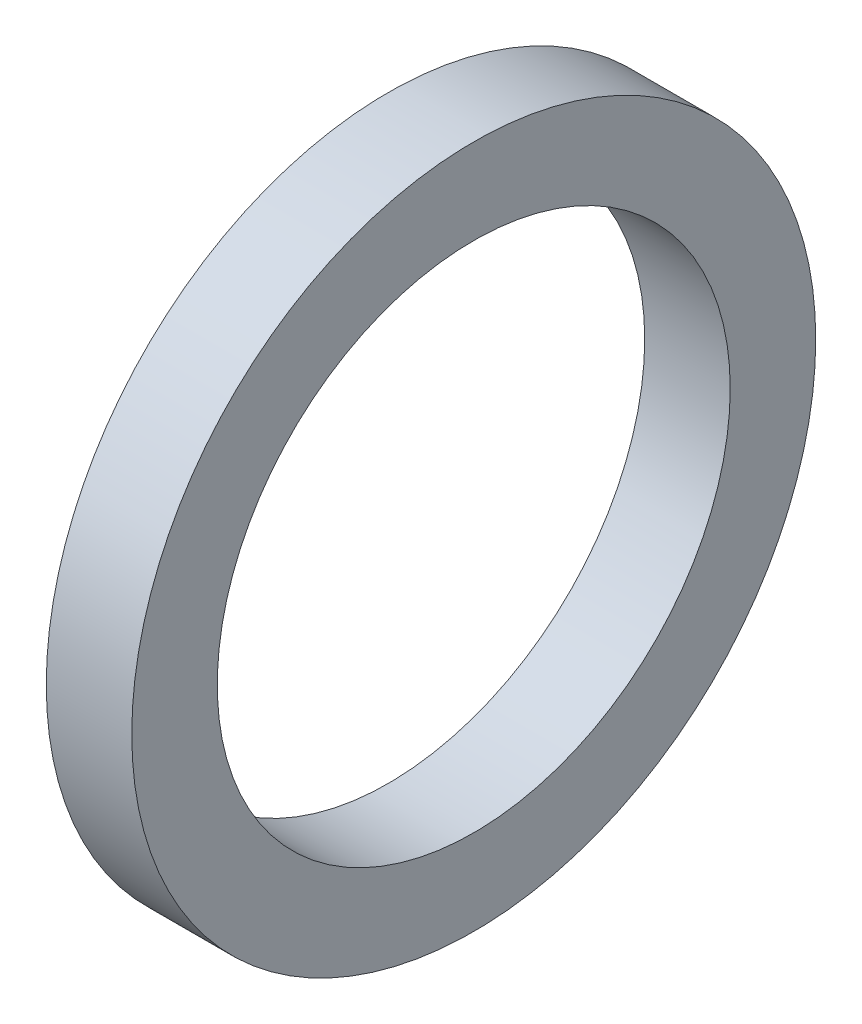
from build123d import *

# Parameters (mm, degrees)
SKETCH1_R           = 12.7
SKETCH1_R_2         = 9.525
BOSS_EXTRUDE1_DEPTH = 3.175


with BuildPart() as part:
    # Sketch1 → Boss-Extrude1 (new body)
    with BuildSketch(Plane(origin=(0, 0, 0), x_dir=(0, 0, -1), z_dir=(1, 0, 0))):
        Circle(SKETCH1_R)
        Circle(SKETCH1_R_2, mode=Mode.SUBTRACT)
    extrude(amount=BOSS_EXTRUDE1_DEPTH)


solid = part.part
